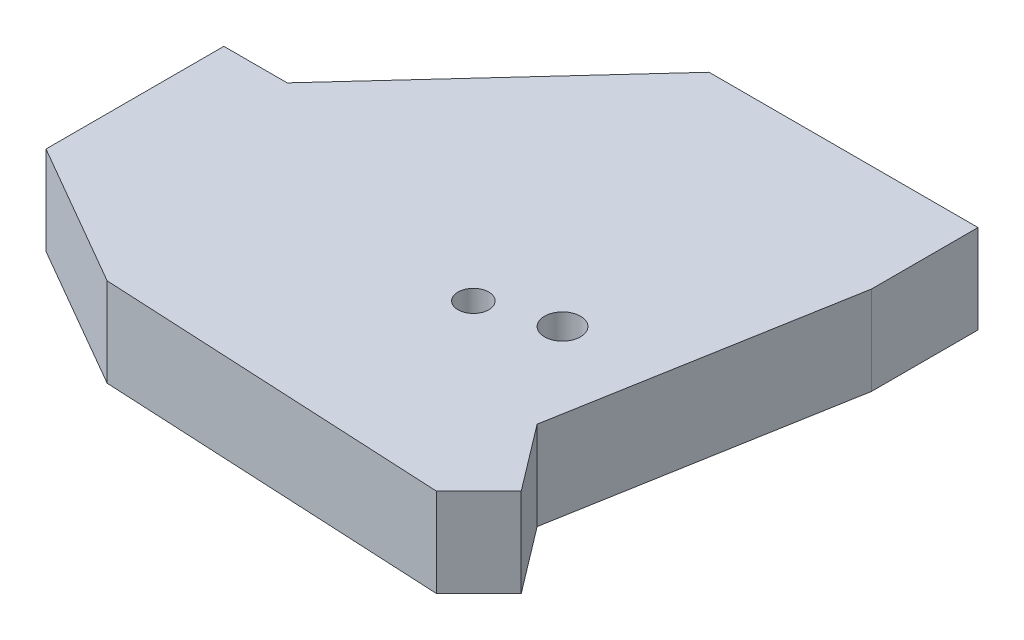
ISO-10303-21;
HEADER;
FILE_DESCRIPTION(('STEP AP214'),'2;1');
FILE_NAME('part.step','',(''),(''),'','','');
FILE_SCHEMA(('AUTOMOTIVE_DESIGN { 1 0 10303 214 1 1 1 1 }'));
ENDSEC;
DATA;
#1=APPLICATION_CONTEXT('core data for automotive mechanical design processes');
#2=APPLICATION_PROTOCOL_DEFINITION('international standard','automotive_design',2000,#1);
#3=PRODUCT_CONTEXT('',#1,'mechanical');
#4=PRODUCT('Part','Part','',(#3));
#5=PRODUCT_RELATED_PRODUCT_CATEGORY('part','',(#4));
#6=PRODUCT_DEFINITION_FORMATION('','',#4);
#7=PRODUCT_DEFINITION_CONTEXT('part definition',#1,'design');
#8=PRODUCT_DEFINITION('design','',#6,#7);
#9=PRODUCT_DEFINITION_SHAPE('','',#8);
#10=(LENGTH_UNIT() NAMED_UNIT(*) SI_UNIT(.MILLI.,.METRE.));
#11=(NAMED_UNIT(*) PLANE_ANGLE_UNIT() SI_UNIT($,.RADIAN.));
#12=(NAMED_UNIT(*) SI_UNIT($,.STERADIAN.) SOLID_ANGLE_UNIT());
#13=UNCERTAINTY_MEASURE_WITH_UNIT(LENGTH_MEASURE(1.E-05),#10,'distance_accuracy_value','');
#14=(GEOMETRIC_REPRESENTATION_CONTEXT(3) GLOBAL_UNCERTAINTY_ASSIGNED_CONTEXT((#13)) GLOBAL_UNIT_ASSIGNED_CONTEXT((#10,
#11,#12)) REPRESENTATION_CONTEXT('',''));
#15=CARTESIAN_POINT('',(0.,0.,0.));
#16=DIRECTION('',(0.,0.,1.));
#17=DIRECTION('',(1.,0.,0.));
#18=AXIS2_PLACEMENT_3D('',#15,#16,#17);
#19=CARTESIAN_POINT('',(-317.33002334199,432.,-183.223277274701));
#20=DIRECTION('',(0.,-1.,0.));
#21=DIRECTION('',(0.,0.,-1.));
#22=AXIS2_PLACEMENT_3D('',#19,#20,#21);
#23=PLANE('',#22);
#24=CARTESIAN_POINT('',(2005.99999926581,432.,-508.880953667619));
#25=DIRECTION('',(0.,1.,0.));
#26=DIRECTION('',(0.,0.,1.));
#27=AXIS2_PLACEMENT_3D('',#24,#25,#26);
#28=CIRCLE('',#27,87.4999999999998);
#29=CARTESIAN_POINT('',(2005.99999926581,432.,-421.380953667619));
#30=VERTEX_POINT('',#29);
#31=EDGE_CURVE('E147',#30,#30,#28,.T.);
#32=ORIENTED_EDGE('',*,*,#31,.F.);
#33=EDGE_LOOP('',(#32));
#34=FACE_BOUND('',#33,.T.);
#35=DIRECTION('',(0.866010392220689,0.,0.500025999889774));
#36=VECTOR('',#35,1.);
#37=CARTESIAN_POINT('',(704.633732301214,432.,406.848681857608));
#38=LINE('',#37,#36);
#39=CARTESIAN_POINT('',(0.,432.,0.));
#40=VERTEX_POINT('',#39);
#41=CARTESIAN_POINT('',(704.633732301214,432.,406.848681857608));
#42=VERTEX_POINT('',#41);
#43=EDGE_CURVE('E162',#40,#42,#38,.T.);
#44=ORIENTED_EDGE('',*,*,#43,.T.);
#45=DIRECTION('',(0.998728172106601,0.,0.0504186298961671));
#46=VECTOR('',#45,1.);
#47=CARTESIAN_POINT('',(2394.0472668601,432.,492.135067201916));
#48=LINE('',#47,#46);
#49=CARTESIAN_POINT('',(2394.0472668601,432.,492.135067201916));
#50=VERTEX_POINT('',#49);
#51=EDGE_CURVE('E100',#42,#50,#48,.T.);
#52=ORIENTED_EDGE('',*,*,#51,.T.);
#53=DIRECTION('',(0.707106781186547,0.,-0.707106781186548));
#54=VECTOR('',#53,1.);
#55=CARTESIAN_POINT('',(2599.97889398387,432.,286.203440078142));
#56=LINE('',#55,#54);
#57=CARTESIAN_POINT('',(2599.97889398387,432.,286.203440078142));
#58=VERTEX_POINT('',#57);
#59=EDGE_CURVE('E183',#50,#58,#56,.T.);
#60=ORIENTED_EDGE('',*,*,#59,.T.);
#61=DIRECTION('',(-0.604599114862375,0.,-0.796529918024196));
#62=VECTOR('',#61,1.);
#63=CARTESIAN_POINT('',(2355.95131871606,432.,-35.2910175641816));
#64=LINE('',#63,#62);
#65=CARTESIAN_POINT('',(2355.95131871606,432.,-35.2910175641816));
#66=VERTEX_POINT('',#65);
#67=EDGE_CURVE('E202',#58,#66,#64,.T.);
#68=ORIENTED_EDGE('',*,*,#67,.T.);
#69=DIRECTION('',(0.173648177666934,0.,-0.984807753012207));
#70=VECTOR('',#69,1.);
#71=CARTESIAN_POINT('',(2599.99999926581,432.,-1419.35986266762));
#72=LINE('',#71,#70);
#73=CARTESIAN_POINT('',(2599.99999926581,432.,-1419.35986266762));
#74=VERTEX_POINT('',#73);
#75=EDGE_CURVE('E199',#66,#74,#72,.T.);
#76=ORIENTED_EDGE('',*,*,#75,.T.);
#77=DIRECTION('',(0.,0.,-1.));
#78=VECTOR('',#77,1.);
#79=CARTESIAN_POINT('',(2599.99999926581,432.,-1937.88095366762));
#80=LINE('',#79,#78);
#81=CARTESIAN_POINT('',(2599.99999926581,432.,-1937.88095366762));
#82=VERTEX_POINT('',#81);
#83=EDGE_CURVE('E201',#74,#82,#80,.T.);
#84=ORIENTED_EDGE('',*,*,#83,.T.);
#85=DIRECTION('',(-1.,0.,0.));
#86=VECTOR('',#85,1.);
#87=CARTESIAN_POINT('',(1290.51750526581,432.,-1937.88095366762));
#88=LINE('',#87,#86);
#89=CARTESIAN_POINT('',(1290.51750526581,432.,-1937.88095366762));
#90=VERTEX_POINT('',#89);
#91=EDGE_CURVE('E125',#82,#90,#88,.T.);
#92=ORIENTED_EDGE('',*,*,#91,.T.);
#93=DIRECTION('',(-0.675590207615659,0.,0.737277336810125));
#94=VECTOR('',#93,1.);
#95=CARTESIAN_POINT('',(308.352807,432.,-866.036269));
#96=LINE('',#95,#94);
#97=CARTESIAN_POINT('',(308.352807,432.,-866.036269));
#98=VERTEX_POINT('',#97);
#99=EDGE_CURVE('E119',#90,#98,#96,.T.);
#100=ORIENTED_EDGE('',*,*,#99,.T.);
#101=DIRECTION('',(-1.,0.,0.));
#102=VECTOR('',#101,1.);
#103=CARTESIAN_POINT('',(0.,432.,-866.036269));
#104=LINE('',#103,#102);
#105=CARTESIAN_POINT('',(0.,432.,-866.036269));
#106=VERTEX_POINT('',#105);
#107=EDGE_CURVE('E123',#98,#106,#104,.T.);
#108=ORIENTED_EDGE('',*,*,#107,.T.);
#109=DIRECTION('',(0.,0.,1.));
#110=VECTOR('',#109,1.);
#111=CARTESIAN_POINT('',(0.,432.,0.));
#112=LINE('',#111,#110);
#113=EDGE_CURVE('E51',#106,#40,#112,.T.);
#114=ORIENTED_EDGE('',*,*,#113,.T.);
#115=EDGE_LOOP('',(#44,#52,#60,#68,#76,#84,#92,#100,#108,#114));
#116=FACE_BOUND('',#115,.T.);
#117=CARTESIAN_POINT('',(1680.99999926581,432.,-399.880953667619));
#118=DIRECTION('',(0.,1.,0.));
#119=DIRECTION('',(0.,0.,1.));
#120=AXIS2_PLACEMENT_3D('',#117,#118,#119);
#121=CIRCLE('',#120,75.);
#122=CARTESIAN_POINT('',(1680.99999926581,432.,-324.880953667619));
#123=VERTEX_POINT('',#122);
#124=EDGE_CURVE('E213',#123,#123,#121,.T.);
#125=ORIENTED_EDGE('',*,*,#124,.F.);
#126=EDGE_LOOP('',(#125));
#127=FACE_BOUND('',#126,.T.);
#128=ADVANCED_FACE('F34',(#34,#116,#127),#23,.F.);
#129=CARTESIAN_POINT('',(-317.33002334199,0.,-183.223277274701));
#130=DIRECTION('',(0.,-1.,0.));
#131=DIRECTION('',(0.,0.,-1.));
#132=AXIS2_PLACEMENT_3D('',#129,#130,#131);
#133=PLANE('',#132);
#134=CARTESIAN_POINT('',(2005.99999926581,0.,-508.880953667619));
#135=DIRECTION('',(0.,1.,0.));
#136=DIRECTION('',(0.,0.,1.));
#137=AXIS2_PLACEMENT_3D('',#134,#135,#136);
#138=CIRCLE('',#137,87.4999999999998);
#139=CARTESIAN_POINT('',(2005.99999926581,0.,-421.380953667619));
#140=VERTEX_POINT('',#139);
#141=EDGE_CURVE('E210',#140,#140,#138,.T.);
#142=ORIENTED_EDGE('',*,*,#141,.T.);
#143=EDGE_LOOP('',(#142));
#144=FACE_BOUND('',#143,.T.);
#145=DIRECTION('',(0.866010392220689,0.,0.500025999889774));
#146=VECTOR('',#145,1.);
#147=CARTESIAN_POINT('',(704.633732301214,0.,406.848681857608));
#148=LINE('',#147,#146);
#149=CARTESIAN_POINT('',(0.,0.,0.));
#150=VERTEX_POINT('',#149);
#151=CARTESIAN_POINT('',(704.633732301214,0.,406.848681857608));
#152=VERTEX_POINT('',#151);
#153=EDGE_CURVE('E143',#150,#152,#148,.T.);
#154=ORIENTED_EDGE('',*,*,#153,.F.);
#155=DIRECTION('',(0.,0.,1.));
#156=VECTOR('',#155,1.);
#157=CARTESIAN_POINT('',(0.,0.,0.));
#158=LINE('',#157,#156);
#159=CARTESIAN_POINT('',(0.,0.,-866.036269));
#160=VERTEX_POINT('',#159);
#161=EDGE_CURVE('E92',#160,#150,#158,.T.);
#162=ORIENTED_EDGE('',*,*,#161,.F.);
#163=DIRECTION('',(-1.,0.,0.));
#164=VECTOR('',#163,1.);
#165=CARTESIAN_POINT('',(0.,0.,-866.036269));
#166=LINE('',#165,#164);
#167=CARTESIAN_POINT('',(308.352807,0.,-866.036269));
#168=VERTEX_POINT('',#167);
#169=EDGE_CURVE('E86',#168,#160,#166,.T.);
#170=ORIENTED_EDGE('',*,*,#169,.F.);
#171=DIRECTION('',(-0.675590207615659,0.,0.737277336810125));
#172=VECTOR('',#171,1.);
#173=CARTESIAN_POINT('',(308.352807,0.,-866.036269));
#174=LINE('',#173,#172);
#175=CARTESIAN_POINT('',(1290.51750526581,0.,-1937.88095366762));
#176=VERTEX_POINT('',#175);
#177=EDGE_CURVE('E133',#176,#168,#174,.T.);
#178=ORIENTED_EDGE('',*,*,#177,.F.);
#179=DIRECTION('',(-1.,0.,0.));
#180=VECTOR('',#179,1.);
#181=CARTESIAN_POINT('',(1290.51750526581,0.,-1937.88095366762));
#182=LINE('',#181,#180);
#183=CARTESIAN_POINT('',(2599.99999926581,0.,-1937.88095366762));
#184=VERTEX_POINT('',#183);
#185=EDGE_CURVE('E157',#184,#176,#182,.T.);
#186=ORIENTED_EDGE('',*,*,#185,.F.);
#187=DIRECTION('',(0.,0.,-1.));
#188=VECTOR('',#187,1.);
#189=CARTESIAN_POINT('',(2599.99999926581,0.,-1937.88095366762));
#190=LINE('',#189,#188);
#191=CARTESIAN_POINT('',(2599.99999926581,0.,-1419.35986266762));
#192=VERTEX_POINT('',#191);
#193=EDGE_CURVE('E155',#192,#184,#190,.T.);
#194=ORIENTED_EDGE('',*,*,#193,.F.);
#195=DIRECTION('',(0.173648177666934,0.,-0.984807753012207));
#196=VECTOR('',#195,1.);
#197=CARTESIAN_POINT('',(2599.99999926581,0.,-1419.35986266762));
#198=LINE('',#197,#196);
#199=CARTESIAN_POINT('',(2355.95131871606,0.,-35.2910175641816));
#200=VERTEX_POINT('',#199);
#201=EDGE_CURVE('E153',#200,#192,#198,.T.);
#202=ORIENTED_EDGE('',*,*,#201,.F.);
#203=DIRECTION('',(-0.604599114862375,0.,-0.796529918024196));
#204=VECTOR('',#203,1.);
#205=CARTESIAN_POINT('',(2355.95131871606,0.,-35.2910175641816));
#206=LINE('',#205,#204);
#207=CARTESIAN_POINT('',(2599.97889398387,0.,286.203440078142));
#208=VERTEX_POINT('',#207);
#209=EDGE_CURVE('E151',#208,#200,#206,.T.);
#210=ORIENTED_EDGE('',*,*,#209,.F.);
#211=DIRECTION('',(0.707106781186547,0.,-0.707106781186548));
#212=VECTOR('',#211,1.);
#213=CARTESIAN_POINT('',(2599.97889398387,0.,286.203440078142));
#214=LINE('',#213,#212);
#215=CARTESIAN_POINT('',(2394.0472668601,0.,492.135067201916));
#216=VERTEX_POINT('',#215);
#217=EDGE_CURVE('E149',#216,#208,#214,.T.);
#218=ORIENTED_EDGE('',*,*,#217,.F.);
#219=DIRECTION('',(0.998728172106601,0.,0.0504186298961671));
#220=VECTOR('',#219,1.);
#221=CARTESIAN_POINT('',(2394.0472668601,0.,492.135067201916));
#222=LINE('',#221,#220);
#223=EDGE_CURVE('E146',#152,#216,#222,.T.);
#224=ORIENTED_EDGE('',*,*,#223,.F.);
#225=EDGE_LOOP('',(#154,#162,#170,#178,#186,#194,#202,#210,#218,#224));
#226=FACE_BOUND('',#225,.T.);
#227=CARTESIAN_POINT('',(1680.99999926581,0.,-399.880953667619));
#228=DIRECTION('',(0.,1.,0.));
#229=DIRECTION('',(0.,0.,1.));
#230=AXIS2_PLACEMENT_3D('',#227,#228,#229);
#231=CIRCLE('',#230,75.);
#232=CARTESIAN_POINT('',(1680.99999926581,0.,-324.880953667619));
#233=VERTEX_POINT('',#232);
#234=EDGE_CURVE('E216',#233,#233,#231,.T.);
#235=ORIENTED_EDGE('',*,*,#234,.T.);
#236=EDGE_LOOP('',(#235));
#237=FACE_BOUND('',#236,.T.);
#238=ADVANCED_FACE('F187',(#144,#226,#237),#133,.T.);
#239=CARTESIAN_POINT('',(704.633732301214,432.,406.848681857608));
#240=DIRECTION('',(0.500025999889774,0.,-0.866010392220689));
#241=DIRECTION('',(-0.866010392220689,0.,-0.500025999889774));
#242=AXIS2_PLACEMENT_3D('',#239,#240,#241);
#243=PLANE('',#242);
#244=ORIENTED_EDGE('',*,*,#153,.T.);
#245=DIRECTION('',(0.,-1.,0.));
#246=VECTOR('',#245,1.);
#247=CARTESIAN_POINT('',(704.633732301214,432.,406.848681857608));
#248=LINE('',#247,#246);
#249=EDGE_CURVE('E11',#42,#152,#248,.T.);
#250=ORIENTED_EDGE('',*,*,#249,.F.);
#251=ORIENTED_EDGE('',*,*,#43,.F.);
#252=DIRECTION('',(0.,-1.,0.));
#253=VECTOR('',#252,1.);
#254=CARTESIAN_POINT('',(0.,432.,0.));
#255=LINE('',#254,#253);
#256=EDGE_CURVE('E139',#40,#150,#255,.T.);
#257=ORIENTED_EDGE('',*,*,#256,.T.);
#258=EDGE_LOOP('',(#244,#250,#251,#257));
#259=FACE_BOUND('',#258,.T.);
#260=ADVANCED_FACE('F36',(#259),#243,.F.);
#261=CARTESIAN_POINT('',(2394.0472668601,432.,492.135067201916));
#262=DIRECTION('',(0.0504186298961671,0.,-0.998728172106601));
#263=DIRECTION('',(-0.998728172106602,0.,-0.0504186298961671));
#264=AXIS2_PLACEMENT_3D('',#261,#262,#263);
#265=PLANE('',#264);
#266=ORIENTED_EDGE('',*,*,#223,.T.);
#267=DIRECTION('',(0.,-1.,0.));
#268=VECTOR('',#267,1.);
#269=CARTESIAN_POINT('',(2394.0472668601,432.,492.135067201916));
#270=LINE('',#269,#268);
#271=EDGE_CURVE('E43',#50,#216,#270,.T.);
#272=ORIENTED_EDGE('',*,*,#271,.F.);
#273=ORIENTED_EDGE('',*,*,#51,.F.);
#274=ORIENTED_EDGE('',*,*,#249,.T.);
#275=EDGE_LOOP('',(#266,#272,#273,#274));
#276=FACE_BOUND('',#275,.T.);
#277=ADVANCED_FACE('F257',(#276),#265,.F.);
#278=CARTESIAN_POINT('',(2599.97889398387,432.,286.203440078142));
#279=DIRECTION('',(-0.707106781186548,0.,-0.707106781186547));
#280=DIRECTION('',(-0.707106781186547,0.,0.707106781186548));
#281=AXIS2_PLACEMENT_3D('',#278,#279,#280);
#282=PLANE('',#281);
#283=ORIENTED_EDGE('',*,*,#217,.T.);
#284=DIRECTION('',(0.,-1.,0.));
#285=VECTOR('',#284,1.);
#286=CARTESIAN_POINT('',(2599.97889398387,432.,286.203440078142));
#287=LINE('',#286,#285);
#288=EDGE_CURVE('E175',#58,#208,#287,.T.);
#289=ORIENTED_EDGE('',*,*,#288,.F.);
#290=ORIENTED_EDGE('',*,*,#59,.F.);
#291=ORIENTED_EDGE('',*,*,#271,.T.);
#292=EDGE_LOOP('',(#283,#289,#290,#291));
#293=FACE_BOUND('',#292,.T.);
#294=ADVANCED_FACE('F181',(#293),#282,.F.);
#295=CARTESIAN_POINT('',(2355.95131871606,432.,-35.2910175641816));
#296=DIRECTION('',(-0.796529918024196,0.,0.604599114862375));
#297=DIRECTION('',(0.604599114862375,0.,0.796529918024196));
#298=AXIS2_PLACEMENT_3D('',#295,#296,#297);
#299=PLANE('',#298);
#300=ORIENTED_EDGE('',*,*,#209,.T.);
#301=DIRECTION('',(0.,-1.,0.));
#302=VECTOR('',#301,1.);
#303=CARTESIAN_POINT('',(2355.95131871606,432.,-35.2910175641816));
#304=LINE('',#303,#302);
#305=EDGE_CURVE('E172',#66,#200,#304,.T.);
#306=ORIENTED_EDGE('',*,*,#305,.F.);
#307=ORIENTED_EDGE('',*,*,#67,.F.);
#308=ORIENTED_EDGE('',*,*,#288,.T.);
#309=EDGE_LOOP('',(#300,#306,#307,#308));
#310=FACE_BOUND('',#309,.T.);
#311=ADVANCED_FACE('F193',(#310),#299,.F.);
#312=CARTESIAN_POINT('',(2599.99999926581,432.,-1419.35986266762));
#313=DIRECTION('',(-0.984807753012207,0.,-0.173648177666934));
#314=DIRECTION('',(-0.173648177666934,0.,0.984807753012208));
#315=AXIS2_PLACEMENT_3D('',#312,#313,#314);
#316=PLANE('',#315);
#317=ORIENTED_EDGE('',*,*,#201,.T.);
#318=DIRECTION('',(0.,-1.,0.));
#319=VECTOR('',#318,1.);
#320=CARTESIAN_POINT('',(2599.99999926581,432.,-1419.35986266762));
#321=LINE('',#320,#319);
#322=EDGE_CURVE('E169',#74,#192,#321,.T.);
#323=ORIENTED_EDGE('',*,*,#322,.F.);
#324=ORIENTED_EDGE('',*,*,#75,.F.);
#325=ORIENTED_EDGE('',*,*,#305,.T.);
#326=EDGE_LOOP('',(#317,#323,#324,#325));
#327=FACE_BOUND('',#326,.T.);
#328=ADVANCED_FACE('F197',(#327),#316,.F.);
#329=CARTESIAN_POINT('',(2599.99999926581,432.,-1937.88095366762));
#330=DIRECTION('',(-1.,0.,0.));
#331=DIRECTION('',(0.,0.,1.));
#332=AXIS2_PLACEMENT_3D('',#329,#330,#331);
#333=PLANE('',#332);
#334=ORIENTED_EDGE('',*,*,#193,.T.);
#335=DIRECTION('',(0.,-1.,0.));
#336=VECTOR('',#335,1.);
#337=CARTESIAN_POINT('',(2599.99999926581,432.,-1937.88095366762));
#338=LINE('',#337,#336);
#339=EDGE_CURVE('E166',#82,#184,#338,.T.);
#340=ORIENTED_EDGE('',*,*,#339,.F.);
#341=ORIENTED_EDGE('',*,*,#83,.F.);
#342=ORIENTED_EDGE('',*,*,#322,.T.);
#343=EDGE_LOOP('',(#334,#340,#341,#342));
#344=FACE_BOUND('',#343,.T.);
#345=ADVANCED_FACE('F247',(#344),#333,.F.);
#346=CARTESIAN_POINT('',(1290.51750526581,432.,-1937.88095366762));
#347=DIRECTION('',(0.,0.,1.));
#348=DIRECTION('',(1.,0.,0.));
#349=AXIS2_PLACEMENT_3D('',#346,#347,#348);
#350=PLANE('',#349);
#351=ORIENTED_EDGE('',*,*,#185,.T.);
#352=DIRECTION('',(0.,-1.,0.));
#353=VECTOR('',#352,1.);
#354=CARTESIAN_POINT('',(1290.51750526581,432.,-1937.88095366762));
#355=LINE('',#354,#353);
#356=EDGE_CURVE('E134',#90,#176,#355,.T.);
#357=ORIENTED_EDGE('',*,*,#356,.F.);
#358=ORIENTED_EDGE('',*,*,#91,.F.);
#359=ORIENTED_EDGE('',*,*,#339,.T.);
#360=EDGE_LOOP('',(#351,#357,#358,#359));
#361=FACE_BOUND('',#360,.T.);
#362=ADVANCED_FACE('F244',(#361),#350,.F.);
#363=CARTESIAN_POINT('',(308.352807,432.,-866.036269));
#364=DIRECTION('',(0.737277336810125,0.,0.675590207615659));
#365=DIRECTION('',(0.675590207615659,0.,-0.737277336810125));
#366=AXIS2_PLACEMENT_3D('',#363,#364,#365);
#367=PLANE('',#366);
#368=ORIENTED_EDGE('',*,*,#177,.T.);
#369=DIRECTION('',(0.,-1.,0.));
#370=VECTOR('',#369,1.);
#371=CARTESIAN_POINT('',(308.352807,432.,-866.036269));
#372=LINE('',#371,#370);
#373=EDGE_CURVE('E130',#98,#168,#372,.T.);
#374=ORIENTED_EDGE('',*,*,#373,.F.);
#375=ORIENTED_EDGE('',*,*,#99,.F.);
#376=ORIENTED_EDGE('',*,*,#356,.T.);
#377=EDGE_LOOP('',(#368,#374,#375,#376));
#378=FACE_BOUND('',#377,.T.);
#379=ADVANCED_FACE('F131',(#378),#367,.F.);
#380=CARTESIAN_POINT('',(0.,432.,-866.036269));
#381=DIRECTION('',(0.,0.,1.));
#382=DIRECTION('',(1.,0.,0.));
#383=AXIS2_PLACEMENT_3D('',#380,#381,#382);
#384=PLANE('',#383);
#385=ORIENTED_EDGE('',*,*,#169,.T.);
#386=DIRECTION('',(0.,-1.,0.));
#387=VECTOR('',#386,1.);
#388=CARTESIAN_POINT('',(0.,432.,-866.036269));
#389=LINE('',#388,#387);
#390=EDGE_CURVE('E135',#106,#160,#389,.T.);
#391=ORIENTED_EDGE('',*,*,#390,.F.);
#392=ORIENTED_EDGE('',*,*,#107,.F.);
#393=ORIENTED_EDGE('',*,*,#373,.T.);
#394=EDGE_LOOP('',(#385,#391,#392,#393));
#395=FACE_BOUND('',#394,.T.);
#396=ADVANCED_FACE('F137',(#395),#384,.F.);
#397=CARTESIAN_POINT('',(0.,432.,0.));
#398=DIRECTION('',(1.,0.,0.));
#399=DIRECTION('',(0.,0.,-1.));
#400=AXIS2_PLACEMENT_3D('',#397,#398,#399);
#401=PLANE('',#400);
#402=ORIENTED_EDGE('',*,*,#161,.T.);
#403=ORIENTED_EDGE('',*,*,#256,.F.);
#404=ORIENTED_EDGE('',*,*,#113,.F.);
#405=ORIENTED_EDGE('',*,*,#390,.T.);
#406=EDGE_LOOP('',(#402,#403,#404,#405));
#407=FACE_BOUND('',#406,.T.);
#408=ADVANCED_FACE('F237',(#407),#401,.F.);
#409=CARTESIAN_POINT('',(2005.99999926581,432.,-508.880953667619));
#410=DIRECTION('',(0.,-1.,0.));
#411=DIRECTION('',(0.,0.,-1.));
#412=AXIS2_PLACEMENT_3D('',#409,#410,#411);
#413=CYLINDRICAL_SURFACE('',#412,87.4999999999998);
#414=ORIENTED_EDGE('',*,*,#31,.T.);
#415=EDGE_LOOP('',(#414));
#416=FACE_BOUND('',#415,.T.);
#417=ORIENTED_EDGE('',*,*,#141,.F.);
#418=EDGE_LOOP('',(#417));
#419=FACE_BOUND('',#418,.T.);
#420=ADVANCED_FACE('F234',(#416,#419),#413,.F.);
#421=CARTESIAN_POINT('',(1680.99999926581,432.,-399.880953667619));
#422=DIRECTION('',(0.,-1.,0.));
#423=DIRECTION('',(0.,0.,-1.));
#424=AXIS2_PLACEMENT_3D('',#421,#422,#423);
#425=CYLINDRICAL_SURFACE('',#424,75.);
#426=ORIENTED_EDGE('',*,*,#124,.T.);
#427=EDGE_LOOP('',(#426));
#428=FACE_BOUND('',#427,.T.);
#429=ORIENTED_EDGE('',*,*,#234,.F.);
#430=EDGE_LOOP('',(#429));
#431=FACE_BOUND('',#430,.T.);
#432=ADVANCED_FACE('F222',(#428,#431),#425,.F.);
#433=CLOSED_SHELL('',(#128,#238,#260,#277,#294,#311,#328,#345,#362,#379,#396,#408,#420,#432));
#434=MANIFOLD_SOLID_BREP('B2',#433);
#435=ADVANCED_BREP_SHAPE_REPRESENTATION('',(#18,#434),#14);
#436=SHAPE_DEFINITION_REPRESENTATION(#9,#435);
ENDSEC;
END-ISO-10303-21;
